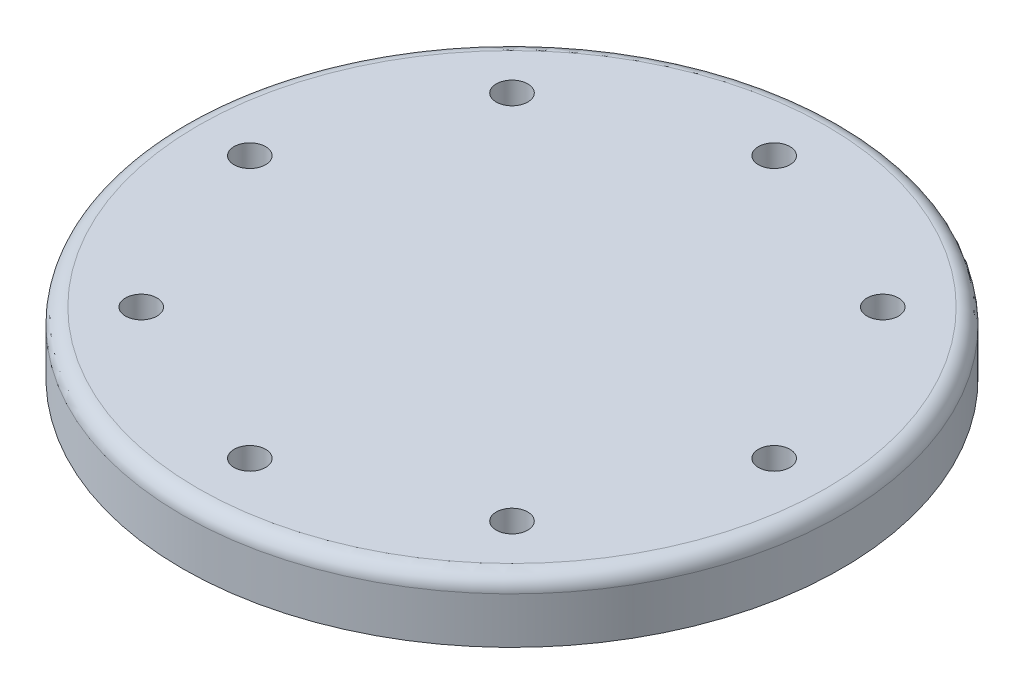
from build123d import *

# Parameters (mm, degrees)
SKETCH1_R           = 50.8
SKETCH1_R_2         = 2.43125
BOSS_EXTRUDE1_DEPTH = 9.525
SKETCH2_R           = 4.7625
CUT_EXTRUDE1_DEPTH  = 4.7625
FILLET1_R           = 2.38125


with BuildPart() as part:
    # Sketch1 → Boss-Extrude1 (new body)
    with BuildSketch(Plane(origin=(0, 0, 0), x_dir=(1, 0, 0), z_dir=(0, 1, 0))):
        with Locations(Location((0, 0, 0), (0, 0, 90))):
            Circle(SKETCH1_R)
        with Locations(Location((-28.575, 28.575, 0), (0, 0, 90))):
            Circle(SKETCH1_R_2, mode=Mode.SUBTRACT)
        with Locations(Location((-28.575, -28.575, 0), (0, 0, 90))):
            Circle(SKETCH1_R_2, mode=Mode.SUBTRACT)
        with Locations(Location((28.575, -28.575, 0), (0, 0, 90))):
            Circle(SKETCH1_R_2, mode=Mode.SUBTRACT)
        with Locations(Location((28.575, 28.575, 0), (0, 0, 90))):
            Circle(SKETCH1_R_2, mode=Mode.SUBTRACT)
        with Locations(Location((0, 40.411152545, 0), (0, 0, 90))):
            Circle(SKETCH1_R_2, mode=Mode.SUBTRACT)
        with Locations(Location((-40.411152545, 0, 0), (0, 0, 90))):
            Circle(SKETCH1_R_2, mode=Mode.SUBTRACT)
        with Locations(Location((0, -40.411152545, 0), (0, 0, 90))):
            Circle(SKETCH1_R_2, mode=Mode.SUBTRACT)
        with Locations(Location((40.411152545, 0, 0), (0, 0, 90))):
            Circle(SKETCH1_R_2, mode=Mode.SUBTRACT)
    extrude(amount=BOSS_EXTRUDE1_DEPTH)

    # Sketch2 → Cut-Extrude1 (cut)
    with BuildSketch(Plane.XZ):
        with Locations(Location((-28.575, 28.575, 0), (0, 0, 270))):
            Circle(SKETCH2_R)
        with Locations(Location((28.575, 28.575, 0), (0, 0, 270))):
            Circle(SKETCH2_R)
        with Locations(Location((-28.575, -28.575, 0), (0, 0, 270))):
            Circle(SKETCH2_R)
        with Locations(Location((28.575, -28.575, 0), (0, 0, 270))):
            Circle(SKETCH2_R)
    extrude(amount=-CUT_EXTRUDE1_DEPTH, mode=Mode.SUBTRACT)

    # Fillet1
    fillet1_edges = [part.edges().sort_by_distance(p)[0] for p in [
        (0, 9.525, 50.8),
    ]]
    fillet(fillet1_edges, radius=FILLET1_R)


solid = part.part
